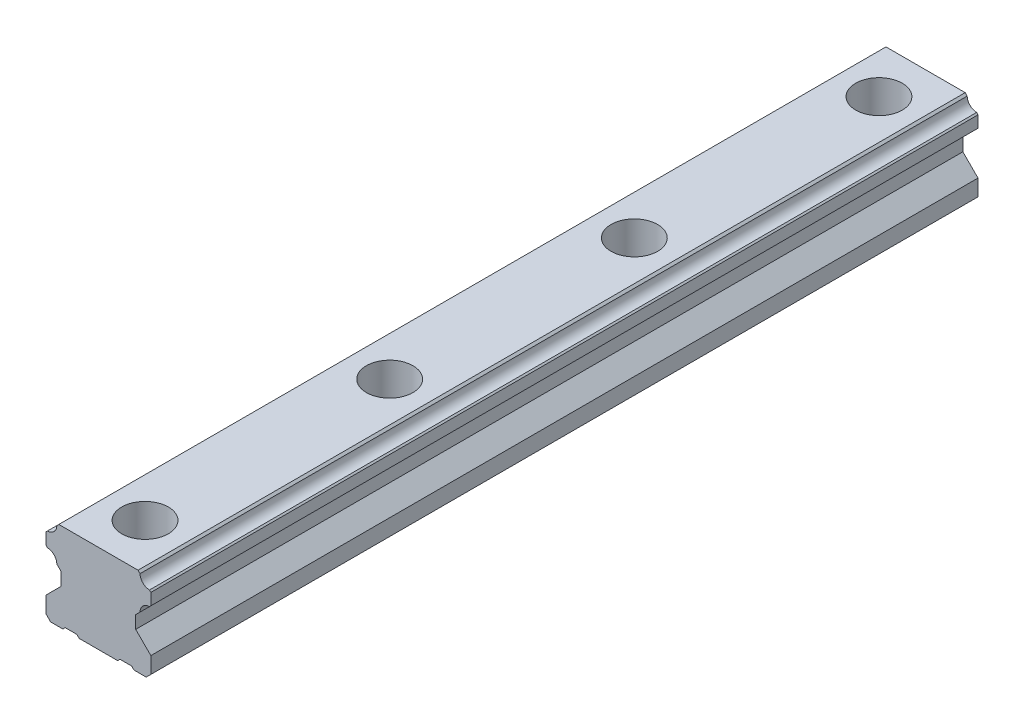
ISO-10303-21;
HEADER;
FILE_DESCRIPTION(('STEP AP214'),'2;1');
FILE_NAME('part.step','',(''),(''),'','','');
FILE_SCHEMA(('AUTOMOTIVE_DESIGN { 1 0 10303 214 1 1 1 1 }'));
ENDSEC;
DATA;
#1=APPLICATION_CONTEXT('core data for automotive mechanical design processes');
#2=APPLICATION_PROTOCOL_DEFINITION('international standard','automotive_design',2000,#1);
#3=PRODUCT_CONTEXT('',#1,'mechanical');
#4=PRODUCT('Part','Part','',(#3));
#5=PRODUCT_RELATED_PRODUCT_CATEGORY('part','',(#4));
#6=PRODUCT_DEFINITION_FORMATION('','',#4);
#7=PRODUCT_DEFINITION_CONTEXT('part definition',#1,'design');
#8=PRODUCT_DEFINITION('design','',#6,#7);
#9=PRODUCT_DEFINITION_SHAPE('','',#8);
#10=(LENGTH_UNIT() NAMED_UNIT(*) SI_UNIT(.MILLI.,.METRE.));
#11=(NAMED_UNIT(*) PLANE_ANGLE_UNIT() SI_UNIT($,.RADIAN.));
#12=(NAMED_UNIT(*) SI_UNIT($,.STERADIAN.) SOLID_ANGLE_UNIT());
#13=UNCERTAINTY_MEASURE_WITH_UNIT(LENGTH_MEASURE(1.E-05),#10,'distance_accuracy_value','');
#14=(GEOMETRIC_REPRESENTATION_CONTEXT(3) GLOBAL_UNCERTAINTY_ASSIGNED_CONTEXT((#13)) GLOBAL_UNIT_ASSIGNED_CONTEXT((#10,
#11,#12)) REPRESENTATION_CONTEXT('',''));
#15=CARTESIAN_POINT('',(0.,0.,0.));
#16=DIRECTION('',(0.,0.,1.));
#17=DIRECTION('',(1.,0.,0.));
#18=AXIS2_PLACEMENT_3D('',#15,#16,#17);
#19=CARTESIAN_POINT('',(-21.9887695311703,37.2219848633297,177.5));
#20=DIRECTION('',(0.,0.,-1.));
#21=DIRECTION('',(-1.,0.,0.));
#22=AXIS2_PLACEMENT_3D('',#19,#20,#21);
#23=CYLINDRICAL_SURFACE('',#22,4.12999916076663);
#24=CARTESIAN_POINT('',(-21.9887695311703,37.2219848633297,-177.5));
#25=DIRECTION('',(0.,0.,-1.));
#26=DIRECTION('',(1.,0.,0.));
#27=AXIS2_PLACEMENT_3D('',#24,#25,#26);
#28=CIRCLE('',#27,4.12999916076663);
#29=CARTESIAN_POINT('',(-17.8595631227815,37.1410682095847,-177.5));
#30=VERTEX_POINT('',#29);
#31=CARTESIAN_POINT('',(-21.9078470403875,33.0927785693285,-177.5));
#32=VERTEX_POINT('',#31);
#33=EDGE_CURVE('E275',#30,#32,#28,.T.);
#34=ORIENTED_EDGE('',*,*,#33,.T.);
#35=DIRECTION('',(0.,0.,-1.));
#36=VECTOR('',#35,1.);
#37=CARTESIAN_POINT('',(-21.9078470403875,33.0927785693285,177.5));
#38=LINE('',#37,#36);
#39=CARTESIAN_POINT('',(-21.9078470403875,33.0927785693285,177.5));
#40=VERTEX_POINT('',#39);
#41=EDGE_CURVE('E11',#40,#32,#38,.T.);
#42=ORIENTED_EDGE('',*,*,#41,.F.);
#43=CARTESIAN_POINT('',(-21.9887695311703,37.2219848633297,177.5));
#44=DIRECTION('',(0.,0.,-1.));
#45=DIRECTION('',(1.,0.,0.));
#46=AXIS2_PLACEMENT_3D('',#43,#44,#45);
#47=CIRCLE('',#46,4.12999916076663);
#48=CARTESIAN_POINT('',(-17.8595631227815,37.1410682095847,177.5));
#49=VERTEX_POINT('',#48);
#50=EDGE_CURVE('E338',#49,#40,#47,.T.);
#51=ORIENTED_EDGE('',*,*,#50,.F.);
#52=DIRECTION('',(0.,0.,-1.));
#53=VECTOR('',#52,1.);
#54=CARTESIAN_POINT('',(-17.8595631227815,37.1410682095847,177.5));
#55=LINE('',#54,#53);
#56=EDGE_CURVE('E271',#49,#30,#55,.T.);
#57=ORIENTED_EDGE('',*,*,#56,.T.);
#58=EDGE_LOOP('',(#34,#42,#51,#57));
#59=FACE_BOUND('',#58,.T.);
#60=ADVANCED_FACE('F35',(#59),#23,.F.);
#61=CARTESIAN_POINT('',(-22.4999999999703,32.5006275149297,177.5));
#62=DIRECTION('',(0.707105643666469,-0.707107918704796,0.));
#63=DIRECTION('',(0.707107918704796,0.707105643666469,0.));
#64=AXIS2_PLACEMENT_3D('',#61,#62,#63);
#65=PLANE('',#64);
#66=DIRECTION('',(-0.707107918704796,-0.707105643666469,0.));
#67=VECTOR('',#66,1.);
#68=CARTESIAN_POINT('',(-22.4999999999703,32.5006275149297,-177.5));
#69=LINE('',#68,#67);
#70=CARTESIAN_POINT('',(-22.4999999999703,32.5006275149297,-177.5));
#71=VERTEX_POINT('',#70);
#72=EDGE_CURVE('E278',#32,#71,#69,.T.);
#73=ORIENTED_EDGE('',*,*,#72,.T.);
#74=DIRECTION('',(0.,0.,-1.));
#75=VECTOR('',#74,1.);
#76=CARTESIAN_POINT('',(-22.4999999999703,32.5006275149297,177.5));
#77=LINE('',#76,#75);
#78=CARTESIAN_POINT('',(-22.4999999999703,32.5006275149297,177.5));
#79=VERTEX_POINT('',#78);
#80=EDGE_CURVE('E43',#79,#71,#77,.T.);
#81=ORIENTED_EDGE('',*,*,#80,.F.);
#82=DIRECTION('',(-0.707107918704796,-0.707105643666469,0.));
#83=VECTOR('',#82,1.);
#84=CARTESIAN_POINT('',(-22.4999999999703,32.5006275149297,177.5));
#85=LINE('',#84,#83);
#86=EDGE_CURVE('E166',#40,#79,#85,.T.);
#87=ORIENTED_EDGE('',*,*,#86,.F.);
#88=ORIENTED_EDGE('',*,*,#41,.T.);
#89=EDGE_LOOP('',(#73,#81,#87,#88));
#90=FACE_BOUND('',#89,.T.);
#91=ADVANCED_FACE('F517',(#90),#65,.F.);
#92=CARTESIAN_POINT('',(-22.4999999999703,32.5006275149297,177.5));
#93=DIRECTION('',(1.,0.,0.));
#94=DIRECTION('',(0.,0.,-1.));
#95=AXIS2_PLACEMENT_3D('',#92,#93,#94);
#96=PLANE('',#95);
#97=DIRECTION('',(0.,-1.,0.));
#98=VECTOR('',#97,1.);
#99=CARTESIAN_POINT('',(-22.4999999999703,32.5006275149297,-177.5));
#100=LINE('',#99,#98);
#101=CARTESIAN_POINT('',(-22.4999999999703,27.4979419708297,-177.5));
#102=VERTEX_POINT('',#101);
#103=EDGE_CURVE('E281',#71,#102,#100,.T.);
#104=ORIENTED_EDGE('',*,*,#103,.T.);
#105=DIRECTION('',(0.,0.,-1.));
#106=VECTOR('',#105,1.);
#107=CARTESIAN_POINT('',(-22.4999999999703,27.4979419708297,177.5));
#108=LINE('',#107,#106);
#109=CARTESIAN_POINT('',(-22.4999999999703,27.4979419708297,177.5));
#110=VERTEX_POINT('',#109);
#111=EDGE_CURVE('E417',#110,#102,#108,.T.);
#112=ORIENTED_EDGE('',*,*,#111,.F.);
#113=DIRECTION('',(0.,-1.,0.));
#114=VECTOR('',#113,1.);
#115=CARTESIAN_POINT('',(-22.4999999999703,32.5006275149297,177.5));
#116=LINE('',#115,#114);
#117=EDGE_CURVE('E425',#79,#110,#116,.T.);
#118=ORIENTED_EDGE('',*,*,#117,.F.);
#119=ORIENTED_EDGE('',*,*,#80,.T.);
#120=EDGE_LOOP('',(#104,#112,#118,#119));
#121=FACE_BOUND('',#120,.T.);
#122=ADVANCED_FACE('F423',(#121),#96,.F.);
#123=CARTESIAN_POINT('',(-21.9103034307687,26.9082454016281,177.5));
#124=DIRECTION('',(0.70710678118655,0.707106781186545,0.));
#125=DIRECTION('',(-0.707106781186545,0.70710678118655,0.));
#126=AXIS2_PLACEMENT_3D('',#123,#124,#125);
#127=PLANE('',#126);
#128=DIRECTION('',(0.707106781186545,-0.707106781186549,0.));
#129=VECTOR('',#128,1.);
#130=CARTESIAN_POINT('',(-21.9103034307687,26.9082454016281,-177.5));
#131=LINE('',#130,#129);
#132=CARTESIAN_POINT('',(-21.9103034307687,26.9082454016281,-177.5));
#133=VERTEX_POINT('',#132);
#134=EDGE_CURVE('E283',#102,#133,#131,.T.);
#135=ORIENTED_EDGE('',*,*,#134,.T.);
#136=DIRECTION('',(0.,0.,-1.));
#137=VECTOR('',#136,1.);
#138=CARTESIAN_POINT('',(-21.9103034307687,26.9082454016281,177.5));
#139=LINE('',#138,#137);
#140=CARTESIAN_POINT('',(-21.9103034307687,26.9082454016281,177.5));
#141=VERTEX_POINT('',#140);
#142=EDGE_CURVE('E414',#141,#133,#139,.T.);
#143=ORIENTED_EDGE('',*,*,#142,.F.);
#144=DIRECTION('',(0.707106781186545,-0.707106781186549,0.));
#145=VECTOR('',#144,1.);
#146=CARTESIAN_POINT('',(-21.9103034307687,26.9082454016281,177.5));
#147=LINE('',#146,#145);
#148=EDGE_CURVE('E443',#110,#141,#147,.T.);
#149=ORIENTED_EDGE('',*,*,#148,.F.);
#150=ORIENTED_EDGE('',*,*,#111,.T.);
#151=EDGE_LOOP('',(#135,#143,#149,#150));
#152=FACE_BOUND('',#151,.T.);
#153=ADVANCED_FACE('F434',(#152),#127,.F.);
#154=CARTESIAN_POINT('',(-21.9887695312,22.7789916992,177.5));
#155=DIRECTION('',(0.,0.,-1.));
#156=DIRECTION('',(-1.,0.,0.));
#157=AXIS2_PLACEMENT_3D('',#154,#155,#156);
#158=CYLINDRICAL_SURFACE('',#157,4.12999916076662);
#159=CARTESIAN_POINT('',(-21.9887695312,22.7789916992,-177.5));
#160=DIRECTION('',(0.,0.,-1.));
#161=DIRECTION('',(1.,0.,0.));
#162=AXIS2_PLACEMENT_3D('',#159,#160,#161);
#163=CIRCLE('',#162,4.12999916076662);
#164=CARTESIAN_POINT('',(-17.8595157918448,22.8574558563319,-177.5));
#165=VERTEX_POINT('',#164);
#166=EDGE_CURVE('E285',#133,#165,#163,.T.);
#167=ORIENTED_EDGE('',*,*,#166,.T.);
#168=DIRECTION('',(0.,0.,-1.));
#169=VECTOR('',#168,1.);
#170=CARTESIAN_POINT('',(-17.8595157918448,22.8574558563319,177.5));
#171=LINE('',#170,#169);
#172=CARTESIAN_POINT('',(-17.8595157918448,22.8574558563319,177.5));
#173=VERTEX_POINT('',#172);
#174=EDGE_CURVE('E411',#173,#165,#171,.T.);
#175=ORIENTED_EDGE('',*,*,#174,.F.);
#176=CARTESIAN_POINT('',(-21.9887695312,22.7789916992,177.5));
#177=DIRECTION('',(0.,0.,-1.));
#178=DIRECTION('',(1.,0.,0.));
#179=AXIS2_PLACEMENT_3D('',#176,#177,#178);
#180=CIRCLE('',#179,4.12999916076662);
#181=EDGE_CURVE('E440',#141,#173,#180,.T.);
#182=ORIENTED_EDGE('',*,*,#181,.F.);
#183=ORIENTED_EDGE('',*,*,#142,.T.);
#184=EDGE_LOOP('',(#167,#175,#182,#183));
#185=FACE_BOUND('',#184,.T.);
#186=ADVANCED_FACE('F438',(#185),#158,.F.);
#187=CARTESIAN_POINT('',(-17.8595157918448,22.8574558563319,177.5));
#188=DIRECTION('',(0.707106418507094,0.707107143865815,0.));
#189=DIRECTION('',(-0.707107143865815,0.707106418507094,0.));
#190=AXIS2_PLACEMENT_3D('',#187,#188,#189);
#191=PLANE('',#190);
#192=DIRECTION('',(0.707107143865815,-0.707106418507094,0.));
#193=VECTOR('',#192,1.);
#194=CARTESIAN_POINT('',(-17.8595157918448,22.8574558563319,-177.5));
#195=LINE('',#194,#193);
#196=CARTESIAN_POINT('',(-16.,20.997941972,-177.5));
#197=VERTEX_POINT('',#196);
#198=EDGE_CURVE('E287',#165,#197,#195,.T.);
#199=ORIENTED_EDGE('',*,*,#198,.T.);
#200=DIRECTION('',(0.,0.,-1.));
#201=VECTOR('',#200,1.);
#202=CARTESIAN_POINT('',(-16.,20.997941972,177.5));
#203=LINE('',#202,#201);
#204=CARTESIAN_POINT('',(-16.,20.997941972,177.5));
#205=VERTEX_POINT('',#204);
#206=EDGE_CURVE('E408',#205,#197,#203,.T.);
#207=ORIENTED_EDGE('',*,*,#206,.F.);
#208=DIRECTION('',(0.707107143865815,-0.707106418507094,0.));
#209=VECTOR('',#208,1.);
#210=CARTESIAN_POINT('',(-17.8595157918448,22.8574558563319,177.5));
#211=LINE('',#210,#209);
#212=EDGE_CURVE('E442',#173,#205,#211,.T.);
#213=ORIENTED_EDGE('',*,*,#212,.F.);
#214=ORIENTED_EDGE('',*,*,#174,.T.);
#215=EDGE_LOOP('',(#199,#207,#213,#214));
#216=FACE_BOUND('',#215,.T.);
#217=ADVANCED_FACE('F530',(#216),#191,.F.);
#218=CARTESIAN_POINT('',(-16.,20.997941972,177.5));
#219=DIRECTION('',(1.,0.,0.));
#220=DIRECTION('',(0.,0.,-1.));
#221=AXIS2_PLACEMENT_3D('',#218,#219,#220);
#222=PLANE('',#221);
#223=DIRECTION('',(0.,-1.,0.));
#224=VECTOR('',#223,1.);
#225=CARTESIAN_POINT('',(-16.,20.997941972,-177.5));
#226=LINE('',#225,#224);
#227=CARTESIAN_POINT('',(-16.,15.5007810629,-177.5));
#228=VERTEX_POINT('',#227);
#229=EDGE_CURVE('E289',#197,#228,#226,.T.);
#230=ORIENTED_EDGE('',*,*,#229,.T.);
#231=DIRECTION('',(0.,0.,-1.));
#232=VECTOR('',#231,1.);
#233=CARTESIAN_POINT('',(-16.,15.5007810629,177.5));
#234=LINE('',#233,#232);
#235=CARTESIAN_POINT('',(-16.,15.5007810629,177.5));
#236=VERTEX_POINT('',#235);
#237=EDGE_CURVE('E405',#236,#228,#234,.T.);
#238=ORIENTED_EDGE('',*,*,#237,.F.);
#239=DIRECTION('',(0.,-1.,0.));
#240=VECTOR('',#239,1.);
#241=CARTESIAN_POINT('',(-16.,20.997941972,177.5));
#242=LINE('',#241,#240);
#243=EDGE_CURVE('E445',#205,#236,#242,.T.);
#244=ORIENTED_EDGE('',*,*,#243,.F.);
#245=ORIENTED_EDGE('',*,*,#206,.T.);
#246=EDGE_LOOP('',(#230,#238,#244,#245));
#247=FACE_BOUND('',#246,.T.);
#248=ADVANCED_FACE('F533',(#247),#222,.F.);
#249=CARTESIAN_POINT('',(-16.,15.5007810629,177.5));
#250=DIRECTION('',(0.707107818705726,-0.707105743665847,0.));
#251=DIRECTION('',(0.707105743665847,0.707107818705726,0.));
#252=AXIS2_PLACEMENT_3D('',#249,#250,#251);
#253=PLANE('',#252);
#254=DIRECTION('',(-0.707105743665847,-0.707107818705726,0.));
#255=VECTOR('',#254,1.);
#256=CARTESIAN_POINT('',(-16.,15.5007810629,-177.5));
#257=LINE('',#256,#255);
#258=CARTESIAN_POINT('',(-22.5,9.0007619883,-177.5));
#259=VERTEX_POINT('',#258);
#260=EDGE_CURVE('E291',#228,#259,#257,.T.);
#261=ORIENTED_EDGE('',*,*,#260,.T.);
#262=DIRECTION('',(0.,0.,-1.));
#263=VECTOR('',#262,1.);
#264=CARTESIAN_POINT('',(-22.5,9.0007619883,177.5));
#265=LINE('',#264,#263);
#266=CARTESIAN_POINT('',(-22.5,9.0007619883,177.5));
#267=VERTEX_POINT('',#266);
#268=EDGE_CURVE('E402',#267,#259,#265,.T.);
#269=ORIENTED_EDGE('',*,*,#268,.F.);
#270=DIRECTION('',(-0.707105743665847,-0.707107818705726,0.));
#271=VECTOR('',#270,1.);
#272=CARTESIAN_POINT('',(-16.,15.5007810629,177.5));
#273=LINE('',#272,#271);
#274=EDGE_CURVE('E451',#236,#267,#273,.T.);
#275=ORIENTED_EDGE('',*,*,#274,.F.);
#276=ORIENTED_EDGE('',*,*,#237,.T.);
#277=EDGE_LOOP('',(#261,#269,#275,#276));
#278=FACE_BOUND('',#277,.T.);
#279=ADVANCED_FACE('F537',(#278),#253,.F.);
#280=CARTESIAN_POINT('',(-22.5,9.0007619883,177.5));
#281=DIRECTION('',(1.,0.,0.));
#282=DIRECTION('',(0.,0.,-1.));
#283=AXIS2_PLACEMENT_3D('',#280,#281,#282);
#284=PLANE('',#283);
#285=DIRECTION('',(0.,-1.,0.));
#286=VECTOR('',#285,1.);
#287=CARTESIAN_POINT('',(-22.5,9.0007619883,-177.5));
#288=LINE('',#287,#286);
#289=CARTESIAN_POINT('',(-22.5,2.,-177.5));
#290=VERTEX_POINT('',#289);
#291=EDGE_CURVE('E293',#259,#290,#288,.T.);
#292=ORIENTED_EDGE('',*,*,#291,.T.);
#293=DIRECTION('',(0.,0.,-1.));
#294=VECTOR('',#293,1.);
#295=CARTESIAN_POINT('',(-22.5,2.,177.5));
#296=LINE('',#295,#294);
#297=CARTESIAN_POINT('',(-22.5,2.,177.5));
#298=VERTEX_POINT('',#297);
#299=EDGE_CURVE('E399',#298,#290,#296,.T.);
#300=ORIENTED_EDGE('',*,*,#299,.F.);
#301=DIRECTION('',(0.,-1.,0.));
#302=VECTOR('',#301,1.);
#303=CARTESIAN_POINT('',(-22.5,9.0007619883,177.5));
#304=LINE('',#303,#302);
#305=EDGE_CURVE('E453',#267,#298,#304,.T.);
#306=ORIENTED_EDGE('',*,*,#305,.F.);
#307=ORIENTED_EDGE('',*,*,#268,.T.);
#308=EDGE_LOOP('',(#292,#300,#306,#307));
#309=FACE_BOUND('',#308,.T.);
#310=ADVANCED_FACE('F541',(#309),#284,.F.);
#311=CARTESIAN_POINT('',(-22.5,2.,177.5));
#312=DIRECTION('',(0.707106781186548,0.707106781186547,0.));
#313=DIRECTION('',(-0.707106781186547,0.707106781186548,0.));
#314=AXIS2_PLACEMENT_3D('',#311,#312,#313);
#315=PLANE('',#314);
#316=DIRECTION('',(0.707106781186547,-0.707106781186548,0.));
#317=VECTOR('',#316,1.);
#318=CARTESIAN_POINT('',(-22.5,2.,-177.5));
#319=LINE('',#318,#317);
#320=CARTESIAN_POINT('',(-20.5,0.,-177.5));
#321=VERTEX_POINT('',#320);
#322=EDGE_CURVE('E295',#290,#321,#319,.T.);
#323=ORIENTED_EDGE('',*,*,#322,.T.);
#324=DIRECTION('',(0.,0.,-1.));
#325=VECTOR('',#324,1.);
#326=CARTESIAN_POINT('',(-20.5,0.,177.5));
#327=LINE('',#326,#325);
#328=CARTESIAN_POINT('',(-20.5,0.,177.5));
#329=VERTEX_POINT('',#328);
#330=EDGE_CURVE('E396',#329,#321,#327,.T.);
#331=ORIENTED_EDGE('',*,*,#330,.F.);
#332=DIRECTION('',(0.707106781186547,-0.707106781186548,0.));
#333=VECTOR('',#332,1.);
#334=CARTESIAN_POINT('',(-22.5,2.,177.5));
#335=LINE('',#334,#333);
#336=EDGE_CURVE('E455',#298,#329,#335,.T.);
#337=ORIENTED_EDGE('',*,*,#336,.F.);
#338=ORIENTED_EDGE('',*,*,#299,.T.);
#339=EDGE_LOOP('',(#323,#331,#337,#338));
#340=FACE_BOUND('',#339,.T.);
#341=ADVANCED_FACE('F545',(#340),#315,.F.);
#342=CARTESIAN_POINT('',(-20.5,0.,177.5));
#343=DIRECTION('',(0.,1.,0.));
#344=DIRECTION('',(0.,0.,1.));
#345=AXIS2_PLACEMENT_3D('',#342,#343,#344);
#346=PLANE('',#345);
#347=DIRECTION('',(1.,0.,0.));
#348=VECTOR('',#347,1.);
#349=CARTESIAN_POINT('',(-20.5,0.,-177.5));
#350=LINE('',#349,#348);
#351=CARTESIAN_POINT('',(-15.25,0.,-177.5));
#352=VERTEX_POINT('',#351);
#353=EDGE_CURVE('E297',#321,#352,#350,.T.);
#354=ORIENTED_EDGE('',*,*,#353,.T.);
#355=DIRECTION('',(0.,0.,-1.));
#356=VECTOR('',#355,1.);
#357=CARTESIAN_POINT('',(-15.25,0.,177.5));
#358=LINE('',#357,#356);
#359=CARTESIAN_POINT('',(-15.25,0.,177.5));
#360=VERTEX_POINT('',#359);
#361=EDGE_CURVE('E393',#360,#352,#358,.T.);
#362=ORIENTED_EDGE('',*,*,#361,.F.);
#363=DIRECTION('',(1.,0.,0.));
#364=VECTOR('',#363,1.);
#365=CARTESIAN_POINT('',(-20.5,0.,177.5));
#366=LINE('',#365,#364);
#367=EDGE_CURVE('E457',#329,#360,#366,.T.);
#368=ORIENTED_EDGE('',*,*,#367,.F.);
#369=ORIENTED_EDGE('',*,*,#330,.T.);
#370=EDGE_LOOP('',(#354,#362,#368,#369));
#371=FACE_BOUND('',#370,.T.);
#372=ADVANCED_FACE('F549',(#371),#346,.F.);
#373=CARTESIAN_POINT('',(-14.25,1.,177.5));
#374=DIRECTION('',(-0.707106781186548,0.707106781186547,0.));
#375=DIRECTION('',(-0.707106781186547,-0.707106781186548,0.));
#376=AXIS2_PLACEMENT_3D('',#373,#374,#375);
#377=PLANE('',#376);
#378=DIRECTION('',(0.707106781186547,0.707106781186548,0.));
#379=VECTOR('',#378,1.);
#380=CARTESIAN_POINT('',(-14.25,1.,-177.5));
#381=LINE('',#380,#379);
#382=CARTESIAN_POINT('',(-14.25,1.,-177.5));
#383=VERTEX_POINT('',#382);
#384=EDGE_CURVE('E299',#352,#383,#381,.T.);
#385=ORIENTED_EDGE('',*,*,#384,.T.);
#386=DIRECTION('',(0.,0.,-1.));
#387=VECTOR('',#386,1.);
#388=CARTESIAN_POINT('',(-14.25,1.,177.5));
#389=LINE('',#388,#387);
#390=CARTESIAN_POINT('',(-14.25,1.,177.5));
#391=VERTEX_POINT('',#390);
#392=EDGE_CURVE('E390',#391,#383,#389,.T.);
#393=ORIENTED_EDGE('',*,*,#392,.F.);
#394=DIRECTION('',(0.707106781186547,0.707106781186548,0.));
#395=VECTOR('',#394,1.);
#396=CARTESIAN_POINT('',(-14.25,1.,177.5));
#397=LINE('',#396,#395);
#398=EDGE_CURVE('E459',#360,#391,#397,.T.);
#399=ORIENTED_EDGE('',*,*,#398,.F.);
#400=ORIENTED_EDGE('',*,*,#361,.T.);
#401=EDGE_LOOP('',(#385,#393,#399,#400));
#402=FACE_BOUND('',#401,.T.);
#403=ADVANCED_FACE('F553',(#402),#377,.F.);
#404=CARTESIAN_POINT('',(-14.25,1.,177.5));
#405=DIRECTION('',(0.,1.,0.));
#406=DIRECTION('',(0.,0.,1.));
#407=AXIS2_PLACEMENT_3D('',#404,#405,#406);
#408=PLANE('',#407);
#409=DIRECTION('',(1.,0.,0.));
#410=VECTOR('',#409,1.);
#411=CARTESIAN_POINT('',(-14.25,1.,-177.5));
#412=LINE('',#411,#410);
#413=CARTESIAN_POINT('',(-9.25,1.,-177.5));
#414=VERTEX_POINT('',#413);
#415=EDGE_CURVE('E301',#383,#414,#412,.T.);
#416=ORIENTED_EDGE('',*,*,#415,.T.);
#417=DIRECTION('',(0.,0.,-1.));
#418=VECTOR('',#417,1.);
#419=CARTESIAN_POINT('',(-9.25,1.,177.5));
#420=LINE('',#419,#418);
#421=CARTESIAN_POINT('',(-9.25,1.,177.5));
#422=VERTEX_POINT('',#421);
#423=EDGE_CURVE('E387',#422,#414,#420,.T.);
#424=ORIENTED_EDGE('',*,*,#423,.F.);
#425=DIRECTION('',(1.,0.,0.));
#426=VECTOR('',#425,1.);
#427=CARTESIAN_POINT('',(-14.25,1.,177.5));
#428=LINE('',#427,#426);
#429=EDGE_CURVE('E461',#391,#422,#428,.T.);
#430=ORIENTED_EDGE('',*,*,#429,.F.);
#431=ORIENTED_EDGE('',*,*,#392,.T.);
#432=EDGE_LOOP('',(#416,#424,#430,#431));
#433=FACE_BOUND('',#432,.T.);
#434=ADVANCED_FACE('F557',(#433),#408,.F.);
#435=CARTESIAN_POINT('',(-8.25,0.,177.5));
#436=DIRECTION('',(0.707106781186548,0.707106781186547,0.));
#437=DIRECTION('',(-0.707106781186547,0.707106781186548,0.));
#438=AXIS2_PLACEMENT_3D('',#435,#436,#437);
#439=PLANE('',#438);
#440=DIRECTION('',(0.707106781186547,-0.707106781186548,0.));
#441=VECTOR('',#440,1.);
#442=CARTESIAN_POINT('',(-8.25,0.,-177.5));
#443=LINE('',#442,#441);
#444=CARTESIAN_POINT('',(-8.25,0.,-177.5));
#445=VERTEX_POINT('',#444);
#446=EDGE_CURVE('E303',#414,#445,#443,.T.);
#447=ORIENTED_EDGE('',*,*,#446,.T.);
#448=DIRECTION('',(0.,0.,-1.));
#449=VECTOR('',#448,1.);
#450=CARTESIAN_POINT('',(-8.25,0.,177.5));
#451=LINE('',#450,#449);
#452=CARTESIAN_POINT('',(-8.25,0.,177.5));
#453=VERTEX_POINT('',#452);
#454=EDGE_CURVE('E384',#453,#445,#451,.T.);
#455=ORIENTED_EDGE('',*,*,#454,.F.);
#456=DIRECTION('',(0.707106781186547,-0.707106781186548,0.));
#457=VECTOR('',#456,1.);
#458=CARTESIAN_POINT('',(-8.25,0.,177.5));
#459=LINE('',#458,#457);
#460=EDGE_CURVE('E463',#422,#453,#459,.T.);
#461=ORIENTED_EDGE('',*,*,#460,.F.);
#462=ORIENTED_EDGE('',*,*,#423,.T.);
#463=EDGE_LOOP('',(#447,#455,#461,#462));
#464=FACE_BOUND('',#463,.T.);
#465=ADVANCED_FACE('F561',(#464),#439,.F.);
#466=CARTESIAN_POINT('',(-8.25,0.,177.5));
#467=DIRECTION('',(0.,1.,0.));
#468=DIRECTION('',(0.,0.,1.));
#469=AXIS2_PLACEMENT_3D('',#466,#467,#468);
#470=PLANE('',#469);
#471=CARTESIAN_POINT('',(0.,0.,-157.5));
#472=DIRECTION('',(0.,1.,0.));
#473=DIRECTION('',(0.,0.,1.));
#474=AXIS2_PLACEMENT_3D('',#471,#472,#473);
#475=CIRCLE('',#474,6.99999999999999);
#476=CARTESIAN_POINT('',(0.,0.,-150.5));
#477=VERTEX_POINT('',#476);
#478=EDGE_CURVE('E818',#477,#477,#475,.T.);
#479=ORIENTED_EDGE('',*,*,#478,.T.);
#480=EDGE_LOOP('',(#479));
#481=FACE_BOUND('',#480,.T.);
#482=CARTESIAN_POINT('',(0.,0.,-52.5));
#483=DIRECTION('',(0.,1.,0.));
#484=DIRECTION('',(0.,0.,1.));
#485=AXIS2_PLACEMENT_3D('',#482,#483,#484);
#486=CIRCLE('',#485,6.99999999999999);
#487=CARTESIAN_POINT('',(0.,0.,-45.5));
#488=VERTEX_POINT('',#487);
#489=EDGE_CURVE('E806',#488,#488,#486,.T.);
#490=ORIENTED_EDGE('',*,*,#489,.T.);
#491=EDGE_LOOP('',(#490));
#492=FACE_BOUND('',#491,.T.);
#493=CARTESIAN_POINT('',(0.,0.,52.5));
#494=DIRECTION('',(0.,1.,0.));
#495=DIRECTION('',(0.,0.,1.));
#496=AXIS2_PLACEMENT_3D('',#493,#494,#495);
#497=CIRCLE('',#496,6.99999999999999);
#498=CARTESIAN_POINT('',(0.,0.,59.5));
#499=VERTEX_POINT('',#498);
#500=EDGE_CURVE('E794',#499,#499,#497,.T.);
#501=ORIENTED_EDGE('',*,*,#500,.T.);
#502=EDGE_LOOP('',(#501));
#503=FACE_BOUND('',#502,.T.);
#504=CARTESIAN_POINT('',(0.,0.,157.5));
#505=DIRECTION('',(0.,1.,0.));
#506=DIRECTION('',(0.,0.,1.));
#507=AXIS2_PLACEMENT_3D('',#504,#505,#506);
#508=CIRCLE('',#507,6.99999999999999);
#509=CARTESIAN_POINT('',(0.,0.,164.5));
#510=VERTEX_POINT('',#509);
#511=EDGE_CURVE('E279',#510,#510,#508,.T.);
#512=ORIENTED_EDGE('',*,*,#511,.T.);
#513=EDGE_LOOP('',(#512));
#514=FACE_BOUND('',#513,.T.);
#515=DIRECTION('',(1.,0.,0.));
#516=VECTOR('',#515,1.);
#517=CARTESIAN_POINT('',(-8.25,0.,-177.5));
#518=LINE('',#517,#516);
#519=CARTESIAN_POINT('',(8.25,0.,-177.5));
#520=VERTEX_POINT('',#519);
#521=EDGE_CURVE('E305',#445,#520,#518,.T.);
#522=ORIENTED_EDGE('',*,*,#521,.T.);
#523=DIRECTION('',(0.,0.,-1.));
#524=VECTOR('',#523,1.);
#525=CARTESIAN_POINT('',(8.25,0.,177.5));
#526=LINE('',#525,#524);
#527=CARTESIAN_POINT('',(8.25,0.,177.5));
#528=VERTEX_POINT('',#527);
#529=EDGE_CURVE('E381',#528,#520,#526,.T.);
#530=ORIENTED_EDGE('',*,*,#529,.F.);
#531=DIRECTION('',(1.,0.,0.));
#532=VECTOR('',#531,1.);
#533=CARTESIAN_POINT('',(-8.25,0.,177.5));
#534=LINE('',#533,#532);
#535=EDGE_CURVE('E465',#453,#528,#534,.T.);
#536=ORIENTED_EDGE('',*,*,#535,.F.);
#537=ORIENTED_EDGE('',*,*,#454,.T.);
#538=EDGE_LOOP('',(#522,#530,#536,#537));
#539=FACE_BOUND('',#538,.T.);
#540=ADVANCED_FACE('F565',(#481,#492,#503,#514,#539),#470,.F.);
#541=CARTESIAN_POINT('',(9.25,1.,177.5));
#542=DIRECTION('',(-0.707106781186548,0.707106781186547,0.));
#543=DIRECTION('',(-0.707106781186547,-0.707106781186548,0.));
#544=AXIS2_PLACEMENT_3D('',#541,#542,#543);
#545=PLANE('',#544);
#546=DIRECTION('',(0.707106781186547,0.707106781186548,0.));
#547=VECTOR('',#546,1.);
#548=CARTESIAN_POINT('',(9.25,1.,-177.5));
#549=LINE('',#548,#547);
#550=CARTESIAN_POINT('',(9.25,1.,-177.5));
#551=VERTEX_POINT('',#550);
#552=EDGE_CURVE('E307',#520,#551,#549,.T.);
#553=ORIENTED_EDGE('',*,*,#552,.T.);
#554=DIRECTION('',(0.,0.,-1.));
#555=VECTOR('',#554,1.);
#556=CARTESIAN_POINT('',(9.25,1.,177.5));
#557=LINE('',#556,#555);
#558=CARTESIAN_POINT('',(9.25,1.,177.5));
#559=VERTEX_POINT('',#558);
#560=EDGE_CURVE('E378',#559,#551,#557,.T.);
#561=ORIENTED_EDGE('',*,*,#560,.F.);
#562=DIRECTION('',(0.707106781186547,0.707106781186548,0.));
#563=VECTOR('',#562,1.);
#564=CARTESIAN_POINT('',(9.25,1.,177.5));
#565=LINE('',#564,#563);
#566=EDGE_CURVE('E467',#528,#559,#565,.T.);
#567=ORIENTED_EDGE('',*,*,#566,.F.);
#568=ORIENTED_EDGE('',*,*,#529,.T.);
#569=EDGE_LOOP('',(#553,#561,#567,#568));
#570=FACE_BOUND('',#569,.T.);
#571=ADVANCED_FACE('F569',(#570),#545,.F.);
#572=CARTESIAN_POINT('',(9.25,1.,177.5));
#573=DIRECTION('',(0.,1.,0.));
#574=DIRECTION('',(0.,0.,1.));
#575=AXIS2_PLACEMENT_3D('',#572,#573,#574);
#576=PLANE('',#575);
#577=DIRECTION('',(1.,0.,0.));
#578=VECTOR('',#577,1.);
#579=CARTESIAN_POINT('',(9.25,1.,-177.5));
#580=LINE('',#579,#578);
#581=CARTESIAN_POINT('',(14.25,1.,-177.5));
#582=VERTEX_POINT('',#581);
#583=EDGE_CURVE('E309',#551,#582,#580,.T.);
#584=ORIENTED_EDGE('',*,*,#583,.T.);
#585=DIRECTION('',(0.,0.,-1.));
#586=VECTOR('',#585,1.);
#587=CARTESIAN_POINT('',(14.25,1.,177.5));
#588=LINE('',#587,#586);
#589=CARTESIAN_POINT('',(14.25,1.,177.5));
#590=VERTEX_POINT('',#589);
#591=EDGE_CURVE('E375',#590,#582,#588,.T.);
#592=ORIENTED_EDGE('',*,*,#591,.F.);
#593=DIRECTION('',(1.,0.,0.));
#594=VECTOR('',#593,1.);
#595=CARTESIAN_POINT('',(9.25,1.,177.5));
#596=LINE('',#595,#594);
#597=EDGE_CURVE('E469',#559,#590,#596,.T.);
#598=ORIENTED_EDGE('',*,*,#597,.F.);
#599=ORIENTED_EDGE('',*,*,#560,.T.);
#600=EDGE_LOOP('',(#584,#592,#598,#599));
#601=FACE_BOUND('',#600,.T.);
#602=ADVANCED_FACE('F573',(#601),#576,.F.);
#603=CARTESIAN_POINT('',(15.25,0.,177.5));
#604=DIRECTION('',(0.707106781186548,0.707106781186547,0.));
#605=DIRECTION('',(-0.707106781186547,0.707106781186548,0.));
#606=AXIS2_PLACEMENT_3D('',#603,#604,#605);
#607=PLANE('',#606);
#608=DIRECTION('',(0.707106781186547,-0.707106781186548,0.));
#609=VECTOR('',#608,1.);
#610=CARTESIAN_POINT('',(15.25,0.,-177.5));
#611=LINE('',#610,#609);
#612=CARTESIAN_POINT('',(15.25,0.,-177.5));
#613=VERTEX_POINT('',#612);
#614=EDGE_CURVE('E311',#582,#613,#611,.T.);
#615=ORIENTED_EDGE('',*,*,#614,.T.);
#616=DIRECTION('',(0.,0.,-1.));
#617=VECTOR('',#616,1.);
#618=CARTESIAN_POINT('',(15.25,0.,177.5));
#619=LINE('',#618,#617);
#620=CARTESIAN_POINT('',(15.25,0.,177.5));
#621=VERTEX_POINT('',#620);
#622=EDGE_CURVE('E372',#621,#613,#619,.T.);
#623=ORIENTED_EDGE('',*,*,#622,.F.);
#624=DIRECTION('',(0.707106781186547,-0.707106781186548,0.));
#625=VECTOR('',#624,1.);
#626=CARTESIAN_POINT('',(15.25,0.,177.5));
#627=LINE('',#626,#625);
#628=EDGE_CURVE('E471',#590,#621,#627,.T.);
#629=ORIENTED_EDGE('',*,*,#628,.F.);
#630=ORIENTED_EDGE('',*,*,#591,.T.);
#631=EDGE_LOOP('',(#615,#623,#629,#630));
#632=FACE_BOUND('',#631,.T.);
#633=ADVANCED_FACE('F577',(#632),#607,.F.);
#634=CARTESIAN_POINT('',(15.25,0.,177.5));
#635=DIRECTION('',(0.,1.,0.));
#636=DIRECTION('',(0.,0.,1.));
#637=AXIS2_PLACEMENT_3D('',#634,#635,#636);
#638=PLANE('',#637);
#639=DIRECTION('',(1.,0.,0.));
#640=VECTOR('',#639,1.);
#641=CARTESIAN_POINT('',(15.25,0.,-177.5));
#642=LINE('',#641,#640);
#643=CARTESIAN_POINT('',(20.5,0.,-177.5));
#644=VERTEX_POINT('',#643);
#645=EDGE_CURVE('E313',#613,#644,#642,.T.);
#646=ORIENTED_EDGE('',*,*,#645,.T.);
#647=DIRECTION('',(0.,0.,-1.));
#648=VECTOR('',#647,1.);
#649=CARTESIAN_POINT('',(20.5,0.,177.5));
#650=LINE('',#649,#648);
#651=CARTESIAN_POINT('',(20.5,0.,177.5));
#652=VERTEX_POINT('',#651);
#653=EDGE_CURVE('E369',#652,#644,#650,.T.);
#654=ORIENTED_EDGE('',*,*,#653,.F.);
#655=DIRECTION('',(1.,0.,0.));
#656=VECTOR('',#655,1.);
#657=CARTESIAN_POINT('',(15.25,0.,177.5));
#658=LINE('',#657,#656);
#659=EDGE_CURVE('E473',#621,#652,#658,.T.);
#660=ORIENTED_EDGE('',*,*,#659,.F.);
#661=ORIENTED_EDGE('',*,*,#622,.T.);
#662=EDGE_LOOP('',(#646,#654,#660,#661));
#663=FACE_BOUND('',#662,.T.);
#664=ADVANCED_FACE('F581',(#663),#638,.F.);
#665=CARTESIAN_POINT('',(20.5,0.,177.5));
#666=DIRECTION('',(-0.707106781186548,0.707106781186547,0.));
#667=DIRECTION('',(-0.707106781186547,-0.707106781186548,0.));
#668=AXIS2_PLACEMENT_3D('',#665,#666,#667);
#669=PLANE('',#668);
#670=DIRECTION('',(0.707106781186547,0.707106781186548,0.));
#671=VECTOR('',#670,1.);
#672=CARTESIAN_POINT('',(20.5,0.,-177.5));
#673=LINE('',#672,#671);
#674=CARTESIAN_POINT('',(22.5,2.,-177.5));
#675=VERTEX_POINT('',#674);
#676=EDGE_CURVE('E315',#644,#675,#673,.T.);
#677=ORIENTED_EDGE('',*,*,#676,.T.);
#678=DIRECTION('',(0.,0.,-1.));
#679=VECTOR('',#678,1.);
#680=CARTESIAN_POINT('',(22.5,2.,177.5));
#681=LINE('',#680,#679);
#682=CARTESIAN_POINT('',(22.5,2.,177.5));
#683=VERTEX_POINT('',#682);
#684=EDGE_CURVE('E366',#683,#675,#681,.T.);
#685=ORIENTED_EDGE('',*,*,#684,.F.);
#686=DIRECTION('',(0.707106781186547,0.707106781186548,0.));
#687=VECTOR('',#686,1.);
#688=CARTESIAN_POINT('',(20.5,0.,177.5));
#689=LINE('',#688,#687);
#690=EDGE_CURVE('E475',#652,#683,#689,.T.);
#691=ORIENTED_EDGE('',*,*,#690,.F.);
#692=ORIENTED_EDGE('',*,*,#653,.T.);
#693=EDGE_LOOP('',(#677,#685,#691,#692));
#694=FACE_BOUND('',#693,.T.);
#695=ADVANCED_FACE('F585',(#694),#669,.F.);
#696=CARTESIAN_POINT('',(22.5,2.,177.5));
#697=DIRECTION('',(-1.,0.,0.));
#698=DIRECTION('',(0.,0.,1.));
#699=AXIS2_PLACEMENT_3D('',#696,#697,#698);
#700=PLANE('',#699);
#701=DIRECTION('',(0.,1.,0.));
#702=VECTOR('',#701,1.);
#703=CARTESIAN_POINT('',(22.5,2.,-177.5));
#704=LINE('',#703,#702);
#705=CARTESIAN_POINT('',(22.5,9.0007619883,-177.5));
#706=VERTEX_POINT('',#705);
#707=EDGE_CURVE('E317',#675,#706,#704,.T.);
#708=ORIENTED_EDGE('',*,*,#707,.T.);
#709=DIRECTION('',(0.,0.,-1.));
#710=VECTOR('',#709,1.);
#711=CARTESIAN_POINT('',(22.5,9.0007619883,177.5));
#712=LINE('',#711,#710);
#713=CARTESIAN_POINT('',(22.5,9.0007619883,177.5));
#714=VERTEX_POINT('',#713);
#715=EDGE_CURVE('E363',#714,#706,#712,.T.);
#716=ORIENTED_EDGE('',*,*,#715,.F.);
#717=DIRECTION('',(0.,1.,0.));
#718=VECTOR('',#717,1.);
#719=CARTESIAN_POINT('',(22.5,2.,177.5));
#720=LINE('',#719,#718);
#721=EDGE_CURVE('E477',#683,#714,#720,.T.);
#722=ORIENTED_EDGE('',*,*,#721,.F.);
#723=ORIENTED_EDGE('',*,*,#684,.T.);
#724=EDGE_LOOP('',(#708,#716,#722,#723));
#725=FACE_BOUND('',#724,.T.);
#726=ADVANCED_FACE('F589',(#725),#700,.F.);
#727=CARTESIAN_POINT('',(22.5,9.0007619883,177.5));
#728=DIRECTION('',(-0.707107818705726,-0.707105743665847,0.));
#729=DIRECTION('',(0.707105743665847,-0.707107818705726,0.));
#730=AXIS2_PLACEMENT_3D('',#727,#728,#729);
#731=PLANE('',#730);
#732=DIRECTION('',(-0.707105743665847,0.707107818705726,0.));
#733=VECTOR('',#732,1.);
#734=CARTESIAN_POINT('',(22.5,9.0007619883,-177.5));
#735=LINE('',#734,#733);
#736=CARTESIAN_POINT('',(16.,15.5007810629,-177.5));
#737=VERTEX_POINT('',#736);
#738=EDGE_CURVE('E319',#706,#737,#735,.T.);
#739=ORIENTED_EDGE('',*,*,#738,.T.);
#740=DIRECTION('',(0.,0.,-1.));
#741=VECTOR('',#740,1.);
#742=CARTESIAN_POINT('',(16.,15.5007810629,177.5));
#743=LINE('',#742,#741);
#744=CARTESIAN_POINT('',(16.,15.5007810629,177.5));
#745=VERTEX_POINT('',#744);
#746=EDGE_CURVE('E360',#745,#737,#743,.T.);
#747=ORIENTED_EDGE('',*,*,#746,.F.);
#748=DIRECTION('',(-0.707105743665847,0.707107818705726,0.));
#749=VECTOR('',#748,1.);
#750=CARTESIAN_POINT('',(22.5,9.0007619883,177.5));
#751=LINE('',#750,#749);
#752=EDGE_CURVE('E479',#714,#745,#751,.T.);
#753=ORIENTED_EDGE('',*,*,#752,.F.);
#754=ORIENTED_EDGE('',*,*,#715,.T.);
#755=EDGE_LOOP('',(#739,#747,#753,#754));
#756=FACE_BOUND('',#755,.T.);
#757=ADVANCED_FACE('F593',(#756),#731,.F.);
#758=CARTESIAN_POINT('',(16.,15.5007810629,177.5));
#759=DIRECTION('',(-1.,0.,0.));
#760=DIRECTION('',(0.,0.,1.));
#761=AXIS2_PLACEMENT_3D('',#758,#759,#760);
#762=PLANE('',#761);
#763=DIRECTION('',(0.,1.,0.));
#764=VECTOR('',#763,1.);
#765=CARTESIAN_POINT('',(16.,15.5007810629,-177.5));
#766=LINE('',#765,#764);
#767=CARTESIAN_POINT('',(16.,20.997941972,-177.5));
#768=VERTEX_POINT('',#767);
#769=EDGE_CURVE('E321',#737,#768,#766,.T.);
#770=ORIENTED_EDGE('',*,*,#769,.T.);
#771=DIRECTION('',(0.,0.,-1.));
#772=VECTOR('',#771,1.);
#773=CARTESIAN_POINT('',(16.,20.997941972,177.5));
#774=LINE('',#773,#772);
#775=CARTESIAN_POINT('',(16.,20.997941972,177.5));
#776=VERTEX_POINT('',#775);
#777=EDGE_CURVE('E357',#776,#768,#774,.T.);
#778=ORIENTED_EDGE('',*,*,#777,.F.);
#779=DIRECTION('',(0.,1.,0.));
#780=VECTOR('',#779,1.);
#781=CARTESIAN_POINT('',(16.,15.5007810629,177.5));
#782=LINE('',#781,#780);
#783=EDGE_CURVE('E481',#745,#776,#782,.T.);
#784=ORIENTED_EDGE('',*,*,#783,.F.);
#785=ORIENTED_EDGE('',*,*,#746,.T.);
#786=EDGE_LOOP('',(#770,#778,#784,#785));
#787=FACE_BOUND('',#786,.T.);
#788=ADVANCED_FACE('F597',(#787),#762,.F.);
#789=CARTESIAN_POINT('',(16.,20.997941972,177.5));
#790=DIRECTION('',(-0.707106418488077,0.707107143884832,0.));
#791=DIRECTION('',(-0.707107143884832,-0.707106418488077,0.));
#792=AXIS2_PLACEMENT_3D('',#789,#790,#791);
#793=PLANE('',#792);
#794=DIRECTION('',(0.707107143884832,0.707106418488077,0.));
#795=VECTOR('',#794,1.);
#796=CARTESIAN_POINT('',(16.,20.997941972,-177.5));
#797=LINE('',#796,#795);
#798=CARTESIAN_POINT('',(17.8595157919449,22.8574558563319,-177.5));
#799=VERTEX_POINT('',#798);
#800=EDGE_CURVE('E323',#768,#799,#797,.T.);
#801=ORIENTED_EDGE('',*,*,#800,.T.);
#802=DIRECTION('',(0.,0.,-1.));
#803=VECTOR('',#802,1.);
#804=CARTESIAN_POINT('',(17.8595157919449,22.8574558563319,177.5));
#805=LINE('',#804,#803);
#806=CARTESIAN_POINT('',(17.8595157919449,22.8574558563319,177.5));
#807=VERTEX_POINT('',#806);
#808=EDGE_CURVE('E354',#807,#799,#805,.T.);
#809=ORIENTED_EDGE('',*,*,#808,.F.);
#810=DIRECTION('',(0.707107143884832,0.707106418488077,0.));
#811=VECTOR('',#810,1.);
#812=CARTESIAN_POINT('',(16.,20.997941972,177.5));
#813=LINE('',#812,#811);
#814=EDGE_CURVE('E483',#776,#807,#813,.T.);
#815=ORIENTED_EDGE('',*,*,#814,.F.);
#816=ORIENTED_EDGE('',*,*,#777,.T.);
#817=EDGE_LOOP('',(#801,#809,#815,#816));
#818=FACE_BOUND('',#817,.T.);
#819=ADVANCED_FACE('F601',(#818),#793,.F.);
#820=CARTESIAN_POINT('',(21.9887695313,22.7789916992,177.5));
#821=DIRECTION('',(0.,0.,-1.));
#822=DIRECTION('',(-1.,0.,0.));
#823=AXIS2_PLACEMENT_3D('',#820,#821,#822);
#824=CYLINDRICAL_SURFACE('',#823,4.1299991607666);
#825=CARTESIAN_POINT('',(21.9887695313,22.7789916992,-177.5));
#826=DIRECTION('',(0.,0.,-1.));
#827=DIRECTION('',(1.,0.,0.));
#828=AXIS2_PLACEMENT_3D('',#825,#826,#827);
#829=CIRCLE('',#828,4.1299991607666);
#830=CARTESIAN_POINT('',(21.9103034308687,26.9082454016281,-177.5));
#831=VERTEX_POINT('',#830);
#832=EDGE_CURVE('E325',#799,#831,#829,.T.);
#833=ORIENTED_EDGE('',*,*,#832,.T.);
#834=DIRECTION('',(0.,0.,-1.));
#835=VECTOR('',#834,1.);
#836=CARTESIAN_POINT('',(21.9103034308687,26.9082454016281,177.5));
#837=LINE('',#836,#835);
#838=CARTESIAN_POINT('',(21.9103034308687,26.9082454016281,177.5));
#839=VERTEX_POINT('',#838);
#840=EDGE_CURVE('E351',#839,#831,#837,.T.);
#841=ORIENTED_EDGE('',*,*,#840,.F.);
#842=CARTESIAN_POINT('',(21.9887695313,22.7789916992,177.5));
#843=DIRECTION('',(0.,0.,-1.));
#844=DIRECTION('',(1.,0.,0.));
#845=AXIS2_PLACEMENT_3D('',#842,#843,#844);
#846=CIRCLE('',#845,4.1299991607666);
#847=EDGE_CURVE('E485',#807,#839,#846,.T.);
#848=ORIENTED_EDGE('',*,*,#847,.F.);
#849=ORIENTED_EDGE('',*,*,#808,.T.);
#850=EDGE_LOOP('',(#833,#841,#848,#849));
#851=FACE_BOUND('',#850,.T.);
#852=ADVANCED_FACE('F605',(#851),#824,.F.);
#853=CARTESIAN_POINT('',(22.5000000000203,27.4979419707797,177.5));
#854=DIRECTION('',(-0.707106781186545,0.70710678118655,0.));
#855=DIRECTION('',(-0.70710678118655,-0.707106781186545,0.));
#856=AXIS2_PLACEMENT_3D('',#853,#854,#855);
#857=PLANE('',#856);
#858=DIRECTION('',(0.70710678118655,0.707106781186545,0.));
#859=VECTOR('',#858,1.);
#860=CARTESIAN_POINT('',(22.5000000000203,27.4979419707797,-177.5));
#861=LINE('',#860,#859);
#862=CARTESIAN_POINT('',(22.5000000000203,27.4979419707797,-177.5));
#863=VERTEX_POINT('',#862);
#864=EDGE_CURVE('E327',#831,#863,#861,.T.);
#865=ORIENTED_EDGE('',*,*,#864,.T.);
#866=DIRECTION('',(0.,0.,-1.));
#867=VECTOR('',#866,1.);
#868=CARTESIAN_POINT('',(22.5000000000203,27.4979419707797,177.5));
#869=LINE('',#868,#867);
#870=CARTESIAN_POINT('',(22.5000000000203,27.4979419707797,177.5));
#871=VERTEX_POINT('',#870);
#872=EDGE_CURVE('E348',#871,#863,#869,.T.);
#873=ORIENTED_EDGE('',*,*,#872,.F.);
#874=DIRECTION('',(0.70710678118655,0.707106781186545,0.));
#875=VECTOR('',#874,1.);
#876=CARTESIAN_POINT('',(22.5000000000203,27.4979419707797,177.5));
#877=LINE('',#876,#875);
#878=EDGE_CURVE('E487',#839,#871,#877,.T.);
#879=ORIENTED_EDGE('',*,*,#878,.F.);
#880=ORIENTED_EDGE('',*,*,#840,.T.);
#881=EDGE_LOOP('',(#865,#873,#879,#880));
#882=FACE_BOUND('',#881,.T.);
#883=ADVANCED_FACE('F609',(#882),#857,.F.);
#884=CARTESIAN_POINT('',(22.5000000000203,27.4979419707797,177.5));
#885=DIRECTION('',(-1.,0.,0.));
#886=DIRECTION('',(0.,0.,1.));
#887=AXIS2_PLACEMENT_3D('',#884,#885,#886);
#888=PLANE('',#887);
#889=DIRECTION('',(0.,1.,0.));
#890=VECTOR('',#889,1.);
#891=CARTESIAN_POINT('',(22.5000000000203,27.4979419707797,-177.5));
#892=LINE('',#891,#890);
#893=CARTESIAN_POINT('',(22.5000000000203,32.5006275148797,-177.5));
#894=VERTEX_POINT('',#893);
#895=EDGE_CURVE('E329',#863,#894,#892,.T.);
#896=ORIENTED_EDGE('',*,*,#895,.T.);
#897=DIRECTION('',(0.,0.,-1.));
#898=VECTOR('',#897,1.);
#899=CARTESIAN_POINT('',(22.5000000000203,32.5006275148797,177.5));
#900=LINE('',#899,#898);
#901=CARTESIAN_POINT('',(22.5000000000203,32.5006275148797,177.5));
#902=VERTEX_POINT('',#901);
#903=EDGE_CURVE('E345',#902,#894,#900,.T.);
#904=ORIENTED_EDGE('',*,*,#903,.F.);
#905=DIRECTION('',(0.,1.,0.));
#906=VECTOR('',#905,1.);
#907=CARTESIAN_POINT('',(22.5000000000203,27.4979419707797,177.5));
#908=LINE('',#907,#906);
#909=EDGE_CURVE('E489',#871,#902,#908,.T.);
#910=ORIENTED_EDGE('',*,*,#909,.F.);
#911=ORIENTED_EDGE('',*,*,#872,.T.);
#912=EDGE_LOOP('',(#896,#904,#910,#911));
#913=FACE_BOUND('',#912,.T.);
#914=ADVANCED_FACE('F613',(#913),#888,.F.);
#915=CARTESIAN_POINT('',(21.9078470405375,33.0927785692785,177.5));
#916=DIRECTION('',(-0.707105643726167,-0.707107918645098,0.));
#917=DIRECTION('',(0.707107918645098,-0.707105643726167,0.));
#918=AXIS2_PLACEMENT_3D('',#915,#916,#917);
#919=PLANE('',#918);
#920=DIRECTION('',(-0.707107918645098,0.707105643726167,0.));
#921=VECTOR('',#920,1.);
#922=CARTESIAN_POINT('',(21.9078470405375,33.0927785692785,-177.5));
#923=LINE('',#922,#921);
#924=CARTESIAN_POINT('',(21.9078470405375,33.0927785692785,-177.5));
#925=VERTEX_POINT('',#924);
#926=EDGE_CURVE('E331',#894,#925,#923,.T.);
#927=ORIENTED_EDGE('',*,*,#926,.T.);
#928=DIRECTION('',(0.,0.,-1.));
#929=VECTOR('',#928,1.);
#930=CARTESIAN_POINT('',(21.9078470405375,33.0927785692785,177.5));
#931=LINE('',#930,#929);
#932=CARTESIAN_POINT('',(21.9078470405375,33.0927785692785,177.5));
#933=VERTEX_POINT('',#932);
#934=EDGE_CURVE('E342',#933,#925,#931,.T.);
#935=ORIENTED_EDGE('',*,*,#934,.F.);
#936=DIRECTION('',(-0.707107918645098,0.707105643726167,0.));
#937=VECTOR('',#936,1.);
#938=CARTESIAN_POINT('',(21.9078470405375,33.0927785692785,177.5));
#939=LINE('',#938,#937);
#940=EDGE_CURVE('E491',#902,#933,#939,.T.);
#941=ORIENTED_EDGE('',*,*,#940,.F.);
#942=ORIENTED_EDGE('',*,*,#903,.T.);
#943=EDGE_LOOP('',(#927,#935,#941,#942));
#944=FACE_BOUND('',#943,.T.);
#945=ADVANCED_FACE('F497',(#944),#919,.F.);
#946=CARTESIAN_POINT('',(21.9887695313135,37.2219848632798,177.5));
#947=DIRECTION('',(0.,0.,-1.));
#948=DIRECTION('',(-1.,0.,0.));
#949=AXIS2_PLACEMENT_3D('',#946,#947,#948);
#950=CYLINDRICAL_SURFACE('',#949,4.12999916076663);
#951=CARTESIAN_POINT('',(21.9887695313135,37.2219848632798,-177.5));
#952=DIRECTION('',(0.,0.,-1.));
#953=DIRECTION('',(1.,0.,0.));
#954=AXIS2_PLACEMENT_3D('',#951,#952,#953);
#955=CIRCLE('',#954,4.12999916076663);
#956=CARTESIAN_POINT('',(17.8595631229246,37.1410682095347,-177.5));
#957=VERTEX_POINT('',#956);
#958=EDGE_CURVE('E333',#925,#957,#955,.T.);
#959=ORIENTED_EDGE('',*,*,#958,.T.);
#960=DIRECTION('',(0.,0.,-1.));
#961=VECTOR('',#960,1.);
#962=CARTESIAN_POINT('',(17.8595631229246,37.1410682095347,177.5));
#963=LINE('',#962,#961);
#964=CARTESIAN_POINT('',(17.8595631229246,37.1410682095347,177.5));
#965=VERTEX_POINT('',#964);
#966=EDGE_CURVE('E266',#965,#957,#963,.T.);
#967=ORIENTED_EDGE('',*,*,#966,.F.);
#968=CARTESIAN_POINT('',(21.9887695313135,37.2219848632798,177.5));
#969=DIRECTION('',(0.,0.,-1.));
#970=DIRECTION('',(1.,0.,0.));
#971=AXIS2_PLACEMENT_3D('',#968,#969,#970);
#972=CIRCLE('',#971,4.12999916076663);
#973=EDGE_CURVE('E257',#933,#965,#972,.T.);
#974=ORIENTED_EDGE('',*,*,#973,.F.);
#975=ORIENTED_EDGE('',*,*,#934,.T.);
#976=EDGE_LOOP('',(#959,#967,#974,#975));
#977=FACE_BOUND('',#976,.T.);
#978=ADVANCED_FACE('F501',(#977),#950,.F.);
#979=CARTESIAN_POINT('',(17.0006313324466,38.0000000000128,177.5));
#980=DIRECTION('',(-0.707106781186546,-0.707106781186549,0.));
#981=DIRECTION('',(0.707106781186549,-0.707106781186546,0.));
#982=AXIS2_PLACEMENT_3D('',#979,#980,#981);
#983=PLANE('',#982);
#984=DIRECTION('',(-0.707106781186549,0.707106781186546,0.));
#985=VECTOR('',#984,1.);
#986=CARTESIAN_POINT('',(17.0006313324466,38.0000000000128,-177.5));
#987=LINE('',#986,#985);
#988=CARTESIAN_POINT('',(17.0006313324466,38.0000000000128,-177.5));
#989=VERTEX_POINT('',#988);
#990=EDGE_CURVE('E265',#957,#989,#987,.T.);
#991=ORIENTED_EDGE('',*,*,#990,.T.);
#992=DIRECTION('',(0.,0.,-1.));
#993=VECTOR('',#992,1.);
#994=CARTESIAN_POINT('',(17.0006313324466,38.0000000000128,177.5));
#995=LINE('',#994,#993);
#996=CARTESIAN_POINT('',(17.0006313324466,38.0000000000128,177.5));
#997=VERTEX_POINT('',#996);
#998=EDGE_CURVE('E262',#997,#989,#995,.T.);
#999=ORIENTED_EDGE('',*,*,#998,.F.);
#1000=DIRECTION('',(-0.707106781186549,0.707106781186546,0.));
#1001=VECTOR('',#1000,1.);
#1002=CARTESIAN_POINT('',(17.0006313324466,38.0000000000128,177.5));
#1003=LINE('',#1002,#1001);
#1004=EDGE_CURVE('E251',#965,#997,#1003,.T.);
#1005=ORIENTED_EDGE('',*,*,#1004,.F.);
#1006=ORIENTED_EDGE('',*,*,#966,.T.);
#1007=EDGE_LOOP('',(#991,#999,#1005,#1006));
#1008=FACE_BOUND('',#1007,.T.);
#1009=ADVANCED_FACE('F263',(#1008),#983,.F.);
#1010=CARTESIAN_POINT('',(-17.0006313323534,38.0000000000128,177.5));
#1011=DIRECTION('',(0.,-1.,0.));
#1012=DIRECTION('',(0.,0.,-1.));
#1013=AXIS2_PLACEMENT_3D('',#1010,#1011,#1012);
#1014=PLANE('',#1013);
#1015=CARTESIAN_POINT('',(0.,38.0000000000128,-157.5));
#1016=DIRECTION('',(0.,1.,0.));
#1017=DIRECTION('',(0.,0.,1.));
#1018=AXIS2_PLACEMENT_3D('',#1015,#1016,#1017);
#1019=CIRCLE('',#1018,10.);
#1020=CARTESIAN_POINT('',(0.,38.0000000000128,-147.5));
#1021=VERTEX_POINT('',#1020);
#1022=EDGE_CURVE('E827',#1021,#1021,#1019,.T.);
#1023=ORIENTED_EDGE('',*,*,#1022,.F.);
#1024=EDGE_LOOP('',(#1023));
#1025=FACE_BOUND('',#1024,.T.);
#1026=CARTESIAN_POINT('',(0.,38.0000000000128,-52.5));
#1027=DIRECTION('',(0.,1.,0.));
#1028=DIRECTION('',(0.,0.,1.));
#1029=AXIS2_PLACEMENT_3D('',#1026,#1027,#1028);
#1030=CIRCLE('',#1029,10.);
#1031=CARTESIAN_POINT('',(0.,38.0000000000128,-42.5));
#1032=VERTEX_POINT('',#1031);
#1033=EDGE_CURVE('E815',#1032,#1032,#1030,.T.);
#1034=ORIENTED_EDGE('',*,*,#1033,.F.);
#1035=EDGE_LOOP('',(#1034));
#1036=FACE_BOUND('',#1035,.T.);
#1037=CARTESIAN_POINT('',(0.,38.0000000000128,52.5));
#1038=DIRECTION('',(0.,1.,0.));
#1039=DIRECTION('',(0.,0.,1.));
#1040=AXIS2_PLACEMENT_3D('',#1037,#1038,#1039);
#1041=CIRCLE('',#1040,10.);
#1042=CARTESIAN_POINT('',(0.,38.0000000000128,62.5));
#1043=VERTEX_POINT('',#1042);
#1044=EDGE_CURVE('E803',#1043,#1043,#1041,.T.);
#1045=ORIENTED_EDGE('',*,*,#1044,.F.);
#1046=EDGE_LOOP('',(#1045));
#1047=FACE_BOUND('',#1046,.T.);
#1048=CARTESIAN_POINT('',(0.,38.0000000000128,157.5));
#1049=DIRECTION('',(0.,1.,0.));
#1050=DIRECTION('',(0.,0.,1.));
#1051=AXIS2_PLACEMENT_3D('',#1048,#1049,#1050);
#1052=CIRCLE('',#1051,10.);
#1053=CARTESIAN_POINT('',(0.,38.0000000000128,167.5));
#1054=VERTEX_POINT('',#1053);
#1055=EDGE_CURVE('E787',#1054,#1054,#1052,.T.);
#1056=ORIENTED_EDGE('',*,*,#1055,.F.);
#1057=EDGE_LOOP('',(#1056));
#1058=FACE_BOUND('',#1057,.T.);
#1059=DIRECTION('',(-1.,0.,0.));
#1060=VECTOR('',#1059,1.);
#1061=CARTESIAN_POINT('',(-17.0006313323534,38.0000000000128,-177.5));
#1062=LINE('',#1061,#1060);
#1063=CARTESIAN_POINT('',(-17.0006313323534,38.0000000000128,-177.5));
#1064=VERTEX_POINT('',#1063);
#1065=EDGE_CURVE('E152',#989,#1064,#1062,.T.);
#1066=ORIENTED_EDGE('',*,*,#1065,.T.);
#1067=DIRECTION('',(0.,0.,-1.));
#1068=VECTOR('',#1067,1.);
#1069=CARTESIAN_POINT('',(-17.0006313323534,38.0000000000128,177.5));
#1070=LINE('',#1069,#1068);
#1071=CARTESIAN_POINT('',(-17.0006313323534,38.0000000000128,177.5));
#1072=VERTEX_POINT('',#1071);
#1073=EDGE_CURVE('E267',#1072,#1064,#1070,.T.);
#1074=ORIENTED_EDGE('',*,*,#1073,.F.);
#1075=DIRECTION('',(-1.,0.,0.));
#1076=VECTOR('',#1075,1.);
#1077=CARTESIAN_POINT('',(-17.0006313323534,38.0000000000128,177.5));
#1078=LINE('',#1077,#1076);
#1079=EDGE_CURVE('E255',#997,#1072,#1078,.T.);
#1080=ORIENTED_EDGE('',*,*,#1079,.F.);
#1081=ORIENTED_EDGE('',*,*,#998,.T.);
#1082=EDGE_LOOP('',(#1066,#1074,#1080,#1081));
#1083=FACE_BOUND('',#1082,.T.);
#1084=ADVANCED_FACE('F269',(#1025,#1036,#1047,#1058,#1083),#1014,.F.);
#1085=CARTESIAN_POINT('',(-17.8595631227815,37.1410682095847,177.5));
#1086=DIRECTION('',(0.707106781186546,-0.707106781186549,0.));
#1087=DIRECTION('',(0.707106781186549,0.707106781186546,0.));
#1088=AXIS2_PLACEMENT_3D('',#1085,#1086,#1087);
#1089=PLANE('',#1088);
#1090=DIRECTION('',(-0.707106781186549,-0.707106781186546,0.));
#1091=VECTOR('',#1090,1.);
#1092=CARTESIAN_POINT('',(-17.8595631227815,37.1410682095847,-177.5));
#1093=LINE('',#1092,#1091);
#1094=EDGE_CURVE('E158',#1064,#30,#1093,.T.);
#1095=ORIENTED_EDGE('',*,*,#1094,.T.);
#1096=ORIENTED_EDGE('',*,*,#56,.F.);
#1097=DIRECTION('',(-0.707106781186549,-0.707106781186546,0.));
#1098=VECTOR('',#1097,1.);
#1099=CARTESIAN_POINT('',(-17.8595631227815,37.1410682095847,177.5));
#1100=LINE('',#1099,#1098);
#1101=EDGE_CURVE('E51',#1072,#49,#1100,.T.);
#1102=ORIENTED_EDGE('',*,*,#1101,.F.);
#1103=ORIENTED_EDGE('',*,*,#1073,.T.);
#1104=EDGE_LOOP('',(#1095,#1096,#1102,#1103));
#1105=FACE_BOUND('',#1104,.T.);
#1106=ADVANCED_FACE('F505',(#1105),#1089,.F.);
#1107=CARTESIAN_POINT('',(-21.9887695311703,37.2219848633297,177.5));
#1108=DIRECTION('',(0.,0.,1.));
#1109=DIRECTION('',(1.,0.,0.));
#1110=AXIS2_PLACEMENT_3D('',#1107,#1108,#1109);
#1111=PLANE('',#1110);
#1112=ORIENTED_EDGE('',*,*,#50,.T.);
#1113=ORIENTED_EDGE('',*,*,#86,.T.);
#1114=ORIENTED_EDGE('',*,*,#117,.T.);
#1115=ORIENTED_EDGE('',*,*,#148,.T.);
#1116=ORIENTED_EDGE('',*,*,#181,.T.);
#1117=ORIENTED_EDGE('',*,*,#212,.T.);
#1118=ORIENTED_EDGE('',*,*,#243,.T.);
#1119=ORIENTED_EDGE('',*,*,#274,.T.);
#1120=ORIENTED_EDGE('',*,*,#305,.T.);
#1121=ORIENTED_EDGE('',*,*,#336,.T.);
#1122=ORIENTED_EDGE('',*,*,#367,.T.);
#1123=ORIENTED_EDGE('',*,*,#398,.T.);
#1124=ORIENTED_EDGE('',*,*,#429,.T.);
#1125=ORIENTED_EDGE('',*,*,#460,.T.);
#1126=ORIENTED_EDGE('',*,*,#535,.T.);
#1127=ORIENTED_EDGE('',*,*,#566,.T.);
#1128=ORIENTED_EDGE('',*,*,#597,.T.);
#1129=ORIENTED_EDGE('',*,*,#628,.T.);
#1130=ORIENTED_EDGE('',*,*,#659,.T.);
#1131=ORIENTED_EDGE('',*,*,#690,.T.);
#1132=ORIENTED_EDGE('',*,*,#721,.T.);
#1133=ORIENTED_EDGE('',*,*,#752,.T.);
#1134=ORIENTED_EDGE('',*,*,#783,.T.);
#1135=ORIENTED_EDGE('',*,*,#814,.T.);
#1136=ORIENTED_EDGE('',*,*,#847,.T.);
#1137=ORIENTED_EDGE('',*,*,#878,.T.);
#1138=ORIENTED_EDGE('',*,*,#909,.T.);
#1139=ORIENTED_EDGE('',*,*,#940,.T.);
#1140=ORIENTED_EDGE('',*,*,#973,.T.);
#1141=ORIENTED_EDGE('',*,*,#1004,.T.);
#1142=ORIENTED_EDGE('',*,*,#1079,.T.);
#1143=ORIENTED_EDGE('',*,*,#1101,.T.);
#1144=EDGE_LOOP('',(#1112,#1113,#1114,#1115,#1116,#1117,#1118,#1119,#1120,#1121,#1122,#1123,
#1124,#1125,#1126,#1127,#1128,#1129,#1130,#1131,#1132,#1133,#1134,#1135,#1136,#1137,#1138,#1139,
#1140,#1141,#1142,#1143));
#1145=FACE_BOUND('',#1144,.T.);
#1146=ADVANCED_FACE('F253',(#1145),#1111,.T.);
#1147=CARTESIAN_POINT('',(-21.9887695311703,37.2219848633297,-177.5));
#1148=DIRECTION('',(0.,0.,1.));
#1149=DIRECTION('',(1.,0.,0.));
#1150=AXIS2_PLACEMENT_3D('',#1147,#1148,#1149);
#1151=PLANE('',#1150);
#1152=ORIENTED_EDGE('',*,*,#33,.F.);
#1153=ORIENTED_EDGE('',*,*,#1094,.F.);
#1154=ORIENTED_EDGE('',*,*,#1065,.F.);
#1155=ORIENTED_EDGE('',*,*,#990,.F.);
#1156=ORIENTED_EDGE('',*,*,#958,.F.);
#1157=ORIENTED_EDGE('',*,*,#926,.F.);
#1158=ORIENTED_EDGE('',*,*,#895,.F.);
#1159=ORIENTED_EDGE('',*,*,#864,.F.);
#1160=ORIENTED_EDGE('',*,*,#832,.F.);
#1161=ORIENTED_EDGE('',*,*,#800,.F.);
#1162=ORIENTED_EDGE('',*,*,#769,.F.);
#1163=ORIENTED_EDGE('',*,*,#738,.F.);
#1164=ORIENTED_EDGE('',*,*,#707,.F.);
#1165=ORIENTED_EDGE('',*,*,#676,.F.);
#1166=ORIENTED_EDGE('',*,*,#645,.F.);
#1167=ORIENTED_EDGE('',*,*,#614,.F.);
#1168=ORIENTED_EDGE('',*,*,#583,.F.);
#1169=ORIENTED_EDGE('',*,*,#552,.F.);
#1170=ORIENTED_EDGE('',*,*,#521,.F.);
#1171=ORIENTED_EDGE('',*,*,#446,.F.);
#1172=ORIENTED_EDGE('',*,*,#415,.F.);
#1173=ORIENTED_EDGE('',*,*,#384,.F.);
#1174=ORIENTED_EDGE('',*,*,#353,.F.);
#1175=ORIENTED_EDGE('',*,*,#322,.F.);
#1176=ORIENTED_EDGE('',*,*,#291,.F.);
#1177=ORIENTED_EDGE('',*,*,#260,.F.);
#1178=ORIENTED_EDGE('',*,*,#229,.F.);
#1179=ORIENTED_EDGE('',*,*,#198,.F.);
#1180=ORIENTED_EDGE('',*,*,#166,.F.);
#1181=ORIENTED_EDGE('',*,*,#134,.F.);
#1182=ORIENTED_EDGE('',*,*,#103,.F.);
#1183=ORIENTED_EDGE('',*,*,#72,.F.);
#1184=EDGE_LOOP('',(#1152,#1153,#1154,#1155,#1156,#1157,#1158,#1159,#1160,#1161,#1162,#1163,
#1164,#1165,#1166,#1167,#1168,#1169,#1170,#1171,#1172,#1173,#1174,#1175,#1176,#1177,#1178,#1179,
#1180,#1181,#1182,#1183));
#1185=FACE_BOUND('',#1184,.T.);
#1186=ADVANCED_FACE('F429',(#1185),#1151,.F.);
#1187=CARTESIAN_POINT('',(0.,38.0000000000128,157.5));
#1188=DIRECTION('',(0.,1.,0.));
#1189=DIRECTION('',(0.,0.,1.));
#1190=AXIS2_PLACEMENT_3D('',#1187,#1188,#1189);
#1191=CYLINDRICAL_SURFACE('',#1190,6.99999999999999);
#1192=ORIENTED_EDGE('',*,*,#511,.F.);
#1193=EDGE_LOOP('',(#1192));
#1194=FACE_BOUND('',#1193,.T.);
#1195=CARTESIAN_POINT('',(0.,21.0000000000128,157.5));
#1196=DIRECTION('',(0.,1.,0.));
#1197=DIRECTION('',(0.,0.,1.));
#1198=AXIS2_PLACEMENT_3D('',#1195,#1196,#1197);
#1199=CIRCLE('',#1198,7.);
#1200=CARTESIAN_POINT('',(0.,21.0000000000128,164.5));
#1201=VERTEX_POINT('',#1200);
#1202=EDGE_CURVE('E782',#1201,#1201,#1199,.T.);
#1203=ORIENTED_EDGE('',*,*,#1202,.T.);
#1204=EDGE_LOOP('',(#1203));
#1205=FACE_BOUND('',#1204,.T.);
#1206=ADVANCED_FACE('F741',(#1194,#1205),#1191,.F.);
#1207=CARTESIAN_POINT('',(7.,21.0000000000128,157.5));
#1208=DIRECTION('',(0.,-1.,0.));
#1209=DIRECTION('',(0.,0.,-1.));
#1210=AXIS2_PLACEMENT_3D('',#1207,#1208,#1209);
#1211=PLANE('',#1210);
#1212=ORIENTED_EDGE('',*,*,#1202,.F.);
#1213=EDGE_LOOP('',(#1212));
#1214=FACE_BOUND('',#1213,.T.);
#1215=CARTESIAN_POINT('',(0.,21.0000000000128,157.5));
#1216=DIRECTION('',(0.,1.,0.));
#1217=DIRECTION('',(0.,0.,1.));
#1218=AXIS2_PLACEMENT_3D('',#1215,#1216,#1217);
#1219=CIRCLE('',#1218,10.);
#1220=CARTESIAN_POINT('',(0.,21.0000000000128,167.5));
#1221=VERTEX_POINT('',#1220);
#1222=EDGE_CURVE('E783',#1221,#1221,#1219,.T.);
#1223=ORIENTED_EDGE('',*,*,#1222,.T.);
#1224=EDGE_LOOP('',(#1223));
#1225=FACE_BOUND('',#1224,.T.);
#1226=ADVANCED_FACE('F737',(#1214,#1225),#1211,.F.);
#1227=CARTESIAN_POINT('',(0.,38.0000000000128,157.5));
#1228=DIRECTION('',(0.,1.,0.));
#1229=DIRECTION('',(0.,0.,1.));
#1230=AXIS2_PLACEMENT_3D('',#1227,#1228,#1229);
#1231=CYLINDRICAL_SURFACE('',#1230,10.);
#1232=ORIENTED_EDGE('',*,*,#1222,.F.);
#1233=EDGE_LOOP('',(#1232));
#1234=FACE_BOUND('',#1233,.T.);
#1235=ORIENTED_EDGE('',*,*,#1055,.T.);
#1236=EDGE_LOOP('',(#1235));
#1237=FACE_BOUND('',#1236,.T.);
#1238=ADVANCED_FACE('F647',(#1234,#1237),#1231,.F.);
#1239=CARTESIAN_POINT('',(0.,38.0000000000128,52.5));
#1240=DIRECTION('',(0.,1.,0.));
#1241=DIRECTION('',(0.,0.,1.));
#1242=AXIS2_PLACEMENT_3D('',#1239,#1240,#1241);
#1243=CYLINDRICAL_SURFACE('',#1242,6.99999999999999);
#1244=ORIENTED_EDGE('',*,*,#500,.F.);
#1245=EDGE_LOOP('',(#1244));
#1246=FACE_BOUND('',#1245,.T.);
#1247=CARTESIAN_POINT('',(0.,21.0000000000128,52.5));
#1248=DIRECTION('',(0.,1.,0.));
#1249=DIRECTION('',(0.,0.,1.));
#1250=AXIS2_PLACEMENT_3D('',#1247,#1248,#1249);
#1251=CIRCLE('',#1250,7.);
#1252=CARTESIAN_POINT('',(0.,21.0000000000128,59.5));
#1253=VERTEX_POINT('',#1252);
#1254=EDGE_CURVE('E797',#1253,#1253,#1251,.T.);
#1255=ORIENTED_EDGE('',*,*,#1254,.T.);
#1256=EDGE_LOOP('',(#1255));
#1257=FACE_BOUND('',#1256,.T.);
#1258=ADVANCED_FACE('F641',(#1246,#1257),#1243,.F.);
#1259=CARTESIAN_POINT('',(7.,21.0000000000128,52.5));
#1260=DIRECTION('',(0.,-1.,0.));
#1261=DIRECTION('',(0.,0.,-1.));
#1262=AXIS2_PLACEMENT_3D('',#1259,#1260,#1261);
#1263=PLANE('',#1262);
#1264=ORIENTED_EDGE('',*,*,#1254,.F.);
#1265=EDGE_LOOP('',(#1264));
#1266=FACE_BOUND('',#1265,.T.);
#1267=CARTESIAN_POINT('',(0.,21.0000000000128,52.5));
#1268=DIRECTION('',(0.,1.,0.));
#1269=DIRECTION('',(0.,0.,1.));
#1270=AXIS2_PLACEMENT_3D('',#1267,#1268,#1269);
#1271=CIRCLE('',#1270,10.);
#1272=CARTESIAN_POINT('',(0.,21.0000000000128,62.5));
#1273=VERTEX_POINT('',#1272);
#1274=EDGE_CURVE('E800',#1273,#1273,#1271,.T.);
#1275=ORIENTED_EDGE('',*,*,#1274,.T.);
#1276=EDGE_LOOP('',(#1275));
#1277=FACE_BOUND('',#1276,.T.);
#1278=ADVANCED_FACE('F646',(#1266,#1277),#1263,.F.);
#1279=CARTESIAN_POINT('',(0.,38.0000000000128,52.5));
#1280=DIRECTION('',(0.,1.,0.));
#1281=DIRECTION('',(0.,0.,1.));
#1282=AXIS2_PLACEMENT_3D('',#1279,#1280,#1281);
#1283=CYLINDRICAL_SURFACE('',#1282,10.);
#1284=ORIENTED_EDGE('',*,*,#1274,.F.);
#1285=EDGE_LOOP('',(#1284));
#1286=FACE_BOUND('',#1285,.T.);
#1287=ORIENTED_EDGE('',*,*,#1044,.T.);
#1288=EDGE_LOOP('',(#1287));
#1289=FACE_BOUND('',#1288,.T.);
#1290=ADVANCED_FACE('F659',(#1286,#1289),#1283,.F.);
#1291=CARTESIAN_POINT('',(0.,38.0000000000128,-52.5));
#1292=DIRECTION('',(0.,1.,0.));
#1293=DIRECTION('',(0.,0.,1.));
#1294=AXIS2_PLACEMENT_3D('',#1291,#1292,#1293);
#1295=CYLINDRICAL_SURFACE('',#1294,6.99999999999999);
#1296=ORIENTED_EDGE('',*,*,#489,.F.);
#1297=EDGE_LOOP('',(#1296));
#1298=FACE_BOUND('',#1297,.T.);
#1299=CARTESIAN_POINT('',(0.,21.0000000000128,-52.5));
#1300=DIRECTION('',(0.,1.,0.));
#1301=DIRECTION('',(0.,0.,1.));
#1302=AXIS2_PLACEMENT_3D('',#1299,#1300,#1301);
#1303=CIRCLE('',#1302,7.);
#1304=CARTESIAN_POINT('',(0.,21.0000000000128,-45.5));
#1305=VERTEX_POINT('',#1304);
#1306=EDGE_CURVE('E809',#1305,#1305,#1303,.T.);
#1307=ORIENTED_EDGE('',*,*,#1306,.T.);
#1308=EDGE_LOOP('',(#1307));
#1309=FACE_BOUND('',#1308,.T.);
#1310=ADVANCED_FACE('F669',(#1298,#1309),#1295,.F.);
#1311=CARTESIAN_POINT('',(7.,21.0000000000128,-52.5));
#1312=DIRECTION('',(0.,-1.,0.));
#1313=DIRECTION('',(0.,0.,-1.));
#1314=AXIS2_PLACEMENT_3D('',#1311,#1312,#1313);
#1315=PLANE('',#1314);
#1316=ORIENTED_EDGE('',*,*,#1306,.F.);
#1317=EDGE_LOOP('',(#1316));
#1318=FACE_BOUND('',#1317,.T.);
#1319=CARTESIAN_POINT('',(0.,21.0000000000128,-52.5));
#1320=DIRECTION('',(0.,1.,0.));
#1321=DIRECTION('',(0.,0.,1.));
#1322=AXIS2_PLACEMENT_3D('',#1319,#1320,#1321);
#1323=CIRCLE('',#1322,10.);
#1324=CARTESIAN_POINT('',(0.,21.0000000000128,-42.5));
#1325=VERTEX_POINT('',#1324);
#1326=EDGE_CURVE('E812',#1325,#1325,#1323,.T.);
#1327=ORIENTED_EDGE('',*,*,#1326,.T.);
#1328=EDGE_LOOP('',(#1327));
#1329=FACE_BOUND('',#1328,.T.);
#1330=ADVANCED_FACE('F679',(#1318,#1329),#1315,.F.);
#1331=CARTESIAN_POINT('',(0.,38.0000000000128,-52.5));
#1332=DIRECTION('',(0.,1.,0.));
#1333=DIRECTION('',(0.,0.,1.));
#1334=AXIS2_PLACEMENT_3D('',#1331,#1332,#1333);
#1335=CYLINDRICAL_SURFACE('',#1334,10.);
#1336=ORIENTED_EDGE('',*,*,#1326,.F.);
#1337=EDGE_LOOP('',(#1336));
#1338=FACE_BOUND('',#1337,.T.);
#1339=ORIENTED_EDGE('',*,*,#1033,.T.);
#1340=EDGE_LOOP('',(#1339));
#1341=FACE_BOUND('',#1340,.T.);
#1342=ADVANCED_FACE('F689',(#1338,#1341),#1335,.F.);
#1343=CARTESIAN_POINT('',(0.,38.0000000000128,-157.5));
#1344=DIRECTION('',(0.,1.,0.));
#1345=DIRECTION('',(0.,0.,1.));
#1346=AXIS2_PLACEMENT_3D('',#1343,#1344,#1345);
#1347=CYLINDRICAL_SURFACE('',#1346,6.99999999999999);
#1348=ORIENTED_EDGE('',*,*,#478,.F.);
#1349=EDGE_LOOP('',(#1348));
#1350=FACE_BOUND('',#1349,.T.);
#1351=CARTESIAN_POINT('',(0.,21.0000000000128,-157.5));
#1352=DIRECTION('',(0.,1.,0.));
#1353=DIRECTION('',(0.,0.,1.));
#1354=AXIS2_PLACEMENT_3D('',#1351,#1352,#1353);
#1355=CIRCLE('',#1354,7.);
#1356=CARTESIAN_POINT('',(0.,21.0000000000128,-150.5));
#1357=VERTEX_POINT('',#1356);
#1358=EDGE_CURVE('E821',#1357,#1357,#1355,.T.);
#1359=ORIENTED_EDGE('',*,*,#1358,.T.);
#1360=EDGE_LOOP('',(#1359));
#1361=FACE_BOUND('',#1360,.T.);
#1362=ADVANCED_FACE('F699',(#1350,#1361),#1347,.F.);
#1363=CARTESIAN_POINT('',(7.,21.0000000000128,-157.5));
#1364=DIRECTION('',(0.,-1.,0.));
#1365=DIRECTION('',(0.,0.,-1.));
#1366=AXIS2_PLACEMENT_3D('',#1363,#1364,#1365);
#1367=PLANE('',#1366);
#1368=ORIENTED_EDGE('',*,*,#1358,.F.);
#1369=EDGE_LOOP('',(#1368));
#1370=FACE_BOUND('',#1369,.T.);
#1371=CARTESIAN_POINT('',(0.,21.0000000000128,-157.5));
#1372=DIRECTION('',(0.,1.,0.));
#1373=DIRECTION('',(0.,0.,1.));
#1374=AXIS2_PLACEMENT_3D('',#1371,#1372,#1373);
#1375=CIRCLE('',#1374,10.);
#1376=CARTESIAN_POINT('',(0.,21.0000000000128,-147.5));
#1377=VERTEX_POINT('',#1376);
#1378=EDGE_CURVE('E824',#1377,#1377,#1375,.T.);
#1379=ORIENTED_EDGE('',*,*,#1378,.T.);
#1380=EDGE_LOOP('',(#1379));
#1381=FACE_BOUND('',#1380,.T.);
#1382=ADVANCED_FACE('F709',(#1370,#1381),#1367,.F.);
#1383=CARTESIAN_POINT('',(0.,38.0000000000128,-157.5));
#1384=DIRECTION('',(0.,1.,0.));
#1385=DIRECTION('',(0.,0.,1.));
#1386=AXIS2_PLACEMENT_3D('',#1383,#1384,#1385);
#1387=CYLINDRICAL_SURFACE('',#1386,10.);
#1388=ORIENTED_EDGE('',*,*,#1378,.F.);
#1389=EDGE_LOOP('',(#1388));
#1390=FACE_BOUND('',#1389,.T.);
#1391=ORIENTED_EDGE('',*,*,#1022,.T.);
#1392=EDGE_LOOP('',(#1391));
#1393=FACE_BOUND('',#1392,.T.);
#1394=ADVANCED_FACE('F719',(#1390,#1393),#1387,.F.);
#1395=CLOSED_SHELL('',(#60,#91,#122,#153,#186,#217,#248,#279,#310,#341,#372,#403,#434,#465,#540,
#571,#602,#633,#664,#695,#726,#757,#788,#819,#852,#883,#914,#945,#978,#1009,#1084,#1106,#1146,
#1186,#1206,#1226,#1238,#1258,#1278,#1290,#1310,#1330,#1342,#1362,#1382,#1394));
#1396=MANIFOLD_SOLID_BREP('B2',#1395);
#1397=ADVANCED_BREP_SHAPE_REPRESENTATION('',(#18,#1396),#14);
#1398=SHAPE_DEFINITION_REPRESENTATION(#9,#1397);
ENDSEC;
END-ISO-10303-21;
